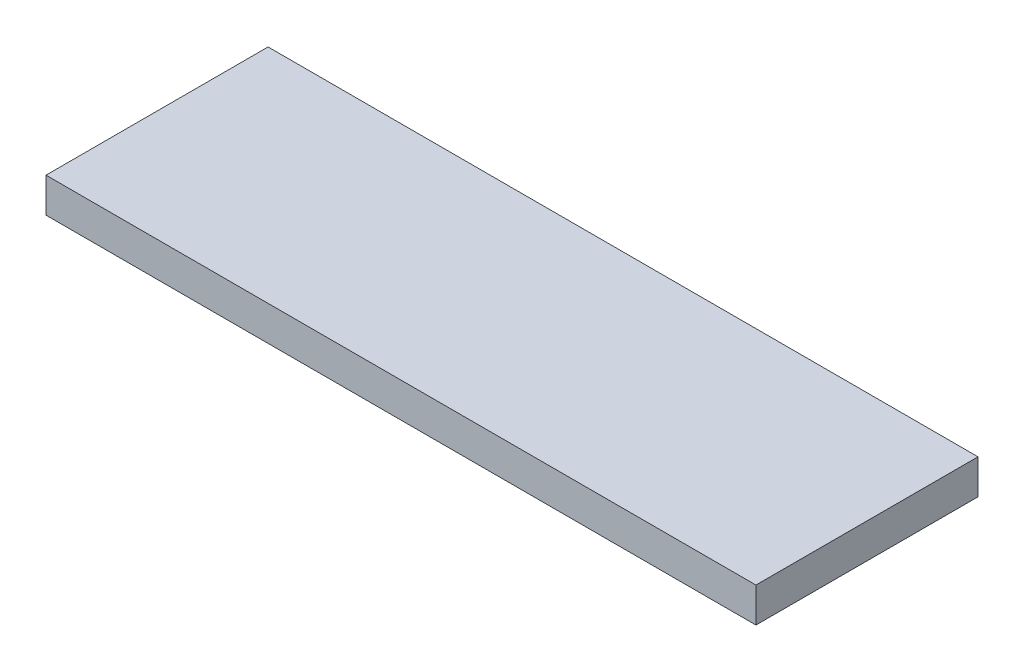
ISO-10303-21;
HEADER;
FILE_DESCRIPTION(('STEP AP214'),'2;1');
FILE_NAME('part.step','',(''),(''),'','','');
FILE_SCHEMA(('AUTOMOTIVE_DESIGN { 1 0 10303 214 1 1 1 1 }'));
ENDSEC;
DATA;
#1=APPLICATION_CONTEXT('core data for automotive mechanical design processes');
#2=APPLICATION_PROTOCOL_DEFINITION('international standard','automotive_design',2000,#1);
#3=PRODUCT_CONTEXT('',#1,'mechanical');
#4=PRODUCT('Part','Part','',(#3));
#5=PRODUCT_RELATED_PRODUCT_CATEGORY('part','',(#4));
#6=PRODUCT_DEFINITION_FORMATION('','',#4);
#7=PRODUCT_DEFINITION_CONTEXT('part definition',#1,'design');
#8=PRODUCT_DEFINITION('design','',#6,#7);
#9=PRODUCT_DEFINITION_SHAPE('','',#8);
#10=(LENGTH_UNIT() NAMED_UNIT(*) SI_UNIT(.MILLI.,.METRE.));
#11=(NAMED_UNIT(*) PLANE_ANGLE_UNIT() SI_UNIT($,.RADIAN.));
#12=(NAMED_UNIT(*) SI_UNIT($,.STERADIAN.) SOLID_ANGLE_UNIT());
#13=UNCERTAINTY_MEASURE_WITH_UNIT(LENGTH_MEASURE(1.E-05),#10,'distance_accuracy_value','');
#14=(GEOMETRIC_REPRESENTATION_CONTEXT(3) GLOBAL_UNCERTAINTY_ASSIGNED_CONTEXT((#13)) GLOBAL_UNIT_ASSIGNED_CONTEXT((#10,
#11,#12)) REPRESENTATION_CONTEXT('',''));
#15=CARTESIAN_POINT('',(0.,0.,0.));
#16=DIRECTION('',(0.,0.,1.));
#17=DIRECTION('',(1.,0.,0.));
#18=AXIS2_PLACEMENT_3D('',#15,#16,#17);
#19=CARTESIAN_POINT('',(195.,19.05,61.));
#20=DIRECTION('',(-1.,0.,0.));
#21=DIRECTION('',(0.,0.,1.));
#22=AXIS2_PLACEMENT_3D('',#19,#20,#21);
#23=PLANE('',#22);
#24=DIRECTION('',(0.,0.,-1.));
#25=VECTOR('',#24,1.);
#26=CARTESIAN_POINT('',(195.,0.,61.));
#27=LINE('',#26,#25);
#28=CARTESIAN_POINT('',(195.,0.,61.));
#29=VERTEX_POINT('',#28);
#30=CARTESIAN_POINT('',(195.,0.,-61.));
#31=VERTEX_POINT('',#30);
#32=EDGE_CURVE('E113',#29,#31,#27,.T.);
#33=ORIENTED_EDGE('',*,*,#32,.T.);
#34=DIRECTION('',(0.,-1.,0.));
#35=VECTOR('',#34,1.);
#36=CARTESIAN_POINT('',(195.,19.05,-61.));
#37=LINE('',#36,#35);
#38=CARTESIAN_POINT('',(195.,19.05,-61.));
#39=VERTEX_POINT('',#38);
#40=EDGE_CURVE('E11',#39,#31,#37,.T.);
#41=ORIENTED_EDGE('',*,*,#40,.F.);
#42=DIRECTION('',(0.,0.,-1.));
#43=VECTOR('',#42,1.);
#44=CARTESIAN_POINT('',(195.,19.05,61.));
#45=LINE('',#44,#43);
#46=CARTESIAN_POINT('',(195.,19.05,61.));
#47=VERTEX_POINT('',#46);
#48=EDGE_CURVE('E97',#47,#39,#45,.T.);
#49=ORIENTED_EDGE('',*,*,#48,.F.);
#50=DIRECTION('',(0.,-1.,0.));
#51=VECTOR('',#50,1.);
#52=CARTESIAN_POINT('',(195.,19.05,61.));
#53=LINE('',#52,#51);
#54=EDGE_CURVE('E107',#47,#29,#53,.T.);
#55=ORIENTED_EDGE('',*,*,#54,.T.);
#56=EDGE_LOOP('',(#33,#41,#49,#55));
#57=FACE_BOUND('',#56,.T.);
#58=ADVANCED_FACE('F44',(#57),#23,.F.);
#59=CARTESIAN_POINT('',(195.,19.05,-61.));
#60=DIRECTION('',(0.,0.,1.));
#61=DIRECTION('',(1.,0.,0.));
#62=AXIS2_PLACEMENT_3D('',#59,#60,#61);
#63=PLANE('',#62);
#64=DIRECTION('',(-1.,0.,0.));
#65=VECTOR('',#64,1.);
#66=CARTESIAN_POINT('',(195.,0.,-61.));
#67=LINE('',#66,#65);
#68=CARTESIAN_POINT('',(-195.,0.,-61.));
#69=VERTEX_POINT('',#68);
#70=EDGE_CURVE('E105',#31,#69,#67,.T.);
#71=ORIENTED_EDGE('',*,*,#70,.T.);
#72=DIRECTION('',(0.,-1.,0.));
#73=VECTOR('',#72,1.);
#74=CARTESIAN_POINT('',(-195.,19.05,-61.));
#75=LINE('',#74,#73);
#76=CARTESIAN_POINT('',(-195.,19.05,-61.));
#77=VERTEX_POINT('',#76);
#78=EDGE_CURVE('E53',#77,#69,#75,.T.);
#79=ORIENTED_EDGE('',*,*,#78,.F.);
#80=DIRECTION('',(-1.,0.,0.));
#81=VECTOR('',#80,1.);
#82=CARTESIAN_POINT('',(195.,19.05,-61.));
#83=LINE('',#82,#81);
#84=EDGE_CURVE('E95',#39,#77,#83,.T.);
#85=ORIENTED_EDGE('',*,*,#84,.F.);
#86=ORIENTED_EDGE('',*,*,#40,.T.);
#87=EDGE_LOOP('',(#71,#79,#85,#86));
#88=FACE_BOUND('',#87,.T.);
#89=ADVANCED_FACE('F103',(#88),#63,.F.);
#90=CARTESIAN_POINT('',(-195.,19.05,61.));
#91=DIRECTION('',(1.,0.,0.));
#92=DIRECTION('',(0.,0.,-1.));
#93=AXIS2_PLACEMENT_3D('',#90,#91,#92);
#94=PLANE('',#93);
#95=DIRECTION('',(0.,0.,1.));
#96=VECTOR('',#95,1.);
#97=CARTESIAN_POINT('',(-195.,0.,61.));
#98=LINE('',#97,#96);
#99=CARTESIAN_POINT('',(-195.,0.,61.));
#100=VERTEX_POINT('',#99);
#101=EDGE_CURVE('E79',#69,#100,#98,.T.);
#102=ORIENTED_EDGE('',*,*,#101,.T.);
#103=DIRECTION('',(0.,-1.,0.));
#104=VECTOR('',#103,1.);
#105=CARTESIAN_POINT('',(-195.,19.05,61.));
#106=LINE('',#105,#104);
#107=CARTESIAN_POINT('',(-195.,19.05,61.));
#108=VERTEX_POINT('',#107);
#109=EDGE_CURVE('E104',#108,#100,#106,.T.);
#110=ORIENTED_EDGE('',*,*,#109,.F.);
#111=DIRECTION('',(0.,0.,1.));
#112=VECTOR('',#111,1.);
#113=CARTESIAN_POINT('',(-195.,19.05,61.));
#114=LINE('',#113,#112);
#115=EDGE_CURVE('E94',#77,#108,#114,.T.);
#116=ORIENTED_EDGE('',*,*,#115,.F.);
#117=ORIENTED_EDGE('',*,*,#78,.T.);
#118=EDGE_LOOP('',(#102,#110,#116,#117));
#119=FACE_BOUND('',#118,.T.);
#120=ADVANCED_FACE('F102',(#119),#94,.F.);
#121=CARTESIAN_POINT('',(195.,19.05,61.));
#122=DIRECTION('',(0.,0.,-1.));
#123=DIRECTION('',(-1.,0.,0.));
#124=AXIS2_PLACEMENT_3D('',#121,#122,#123);
#125=PLANE('',#124);
#126=DIRECTION('',(1.,0.,0.));
#127=VECTOR('',#126,1.);
#128=CARTESIAN_POINT('',(195.,0.,61.));
#129=LINE('',#128,#127);
#130=EDGE_CURVE('E83',#100,#29,#129,.T.);
#131=ORIENTED_EDGE('',*,*,#130,.T.);
#132=ORIENTED_EDGE('',*,*,#54,.F.);
#133=DIRECTION('',(1.,0.,0.));
#134=VECTOR('',#133,1.);
#135=CARTESIAN_POINT('',(195.,19.05,61.));
#136=LINE('',#135,#134);
#137=EDGE_CURVE('E65',#108,#47,#136,.T.);
#138=ORIENTED_EDGE('',*,*,#137,.F.);
#139=ORIENTED_EDGE('',*,*,#109,.T.);
#140=EDGE_LOOP('',(#131,#132,#138,#139));
#141=FACE_BOUND('',#140,.T.);
#142=ADVANCED_FACE('F127',(#141),#125,.F.);
#143=CARTESIAN_POINT('',(0.,19.05,0.));
#144=DIRECTION('',(0.,1.,0.));
#145=DIRECTION('',(0.,0.,1.));
#146=AXIS2_PLACEMENT_3D('',#143,#144,#145);
#147=PLANE('',#146);
#148=ORIENTED_EDGE('',*,*,#48,.T.);
#149=ORIENTED_EDGE('',*,*,#84,.T.);
#150=ORIENTED_EDGE('',*,*,#115,.T.);
#151=ORIENTED_EDGE('',*,*,#137,.T.);
#152=EDGE_LOOP('',(#148,#149,#150,#151));
#153=FACE_BOUND('',#152,.T.);
#154=ADVANCED_FACE('F92',(#153),#147,.T.);
#155=CARTESIAN_POINT('',(0.,0.,0.));
#156=DIRECTION('',(0.,1.,0.));
#157=DIRECTION('',(0.,0.,1.));
#158=AXIS2_PLACEMENT_3D('',#155,#156,#157);
#159=PLANE('',#158);
#160=ORIENTED_EDGE('',*,*,#32,.F.);
#161=ORIENTED_EDGE('',*,*,#130,.F.);
#162=ORIENTED_EDGE('',*,*,#101,.F.);
#163=ORIENTED_EDGE('',*,*,#70,.F.);
#164=EDGE_LOOP('',(#160,#161,#162,#163));
#165=FACE_BOUND('',#164,.T.);
#166=ADVANCED_FACE('F126',(#165),#159,.F.);
#167=CLOSED_SHELL('',(#58,#89,#120,#142,#154,#166));
#168=MANIFOLD_SOLID_BREP('B2',#167);
#169=ADVANCED_BREP_SHAPE_REPRESENTATION('',(#18,#168),#14);
#170=SHAPE_DEFINITION_REPRESENTATION(#9,#169);
ENDSEC;
END-ISO-10303-21;
